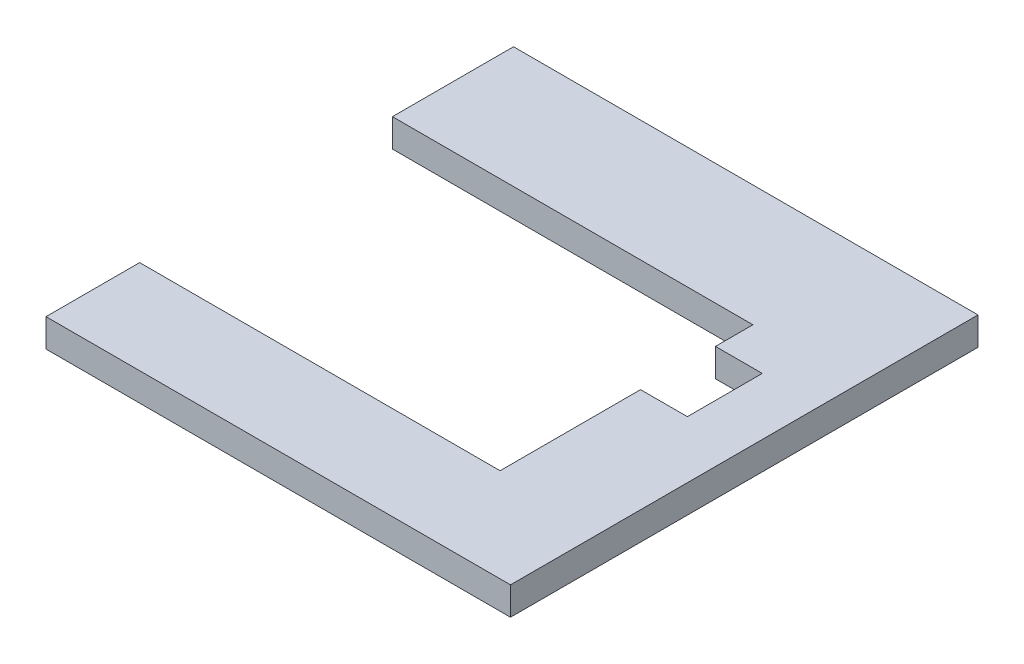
from build123d import *

# Parameters (mm, degrees)
BOSS_EXTRUDE1_DEPTH = 3


with BuildPart() as part:
    # Sketch1 → Boss-Extrude1 (new body)
    with BuildSketch(Plane(origin=(0, 0, 0), x_dir=(1, 0, 0), z_dir=(0, 1, 0))):
        Polygon((0, 0), (0, 10), (38.5, 10), (38.5, 25), (43.5, 25), (43.5, 33), (38.5, 33), (38.5, 37), (0, 37), (0, 49.931989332), (49.610237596, 49.931989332), (49.610237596, 0), align=None)
    extrude(amount=BOSS_EXTRUDE1_DEPTH)


solid = part.part
